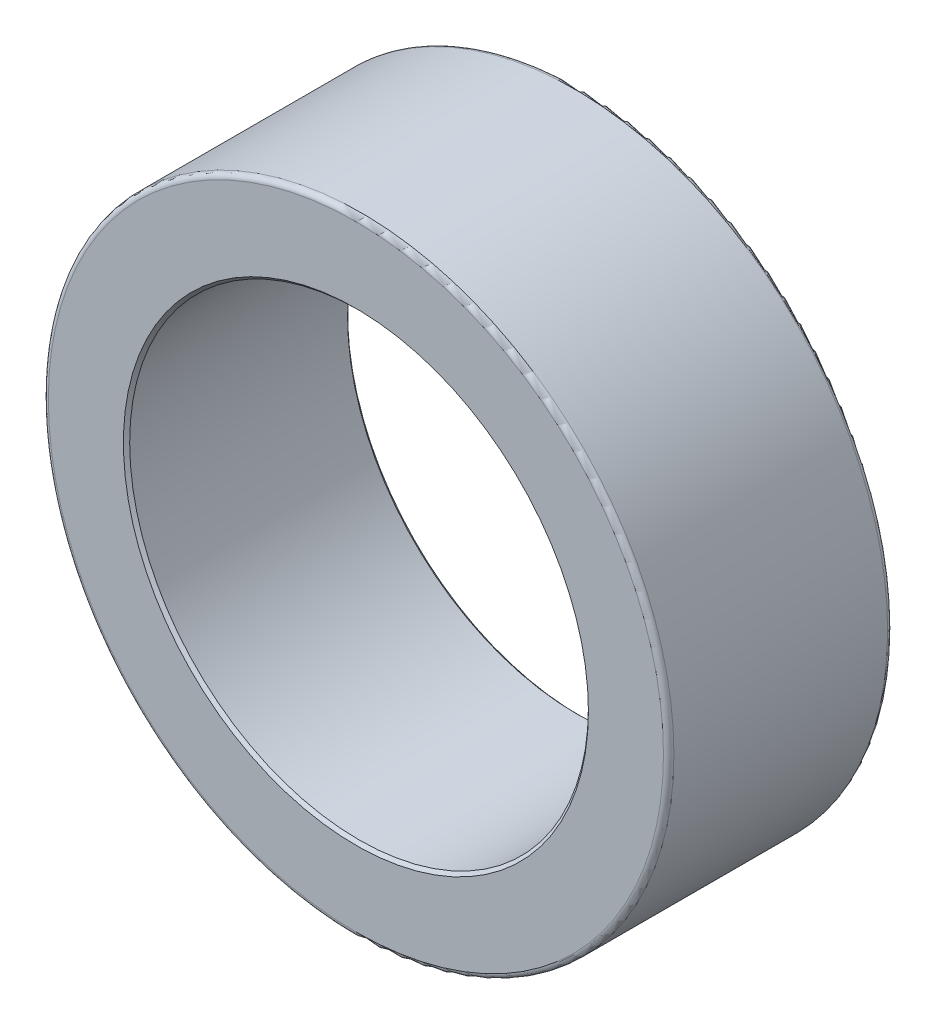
from build123d import *

# Parameters (mm, degrees)
ESQUISSE1_R          = 30
ESQUISSE1_R_2        = 22
BASE_EXTRUSION_DEPTH = 21.5
CONG_2_R             = 0.5
CHANFREIN1_SIZE      = 0.3


with BuildPart() as part:
    # Esquisse1 → Base-Extrusion (new body)
    with BuildSketch(Plane.XY):
        Circle(ESQUISSE1_R)
        Circle(ESQUISSE1_R_2, mode=Mode.SUBTRACT)
    extrude(amount=-BASE_EXTRUSION_DEPTH)

    # Cong_2
    cong_2_edges = [part.edges().sort_by_distance(p)[0] for p in [
        (-30, 0, 0),
        (-30, 0, -21.5),
    ]]
    fillet(cong_2_edges, radius=CONG_2_R)

    # Chanfrein1
    chanfrein1_edges = [part.edges().sort_by_distance(p)[0] for p in [
        (-22, 0, 0),
        (-22, 0, -21.5),
    ]]
    chamfer(chanfrein1_edges, length=CHANFREIN1_SIZE)


solid = part.part
